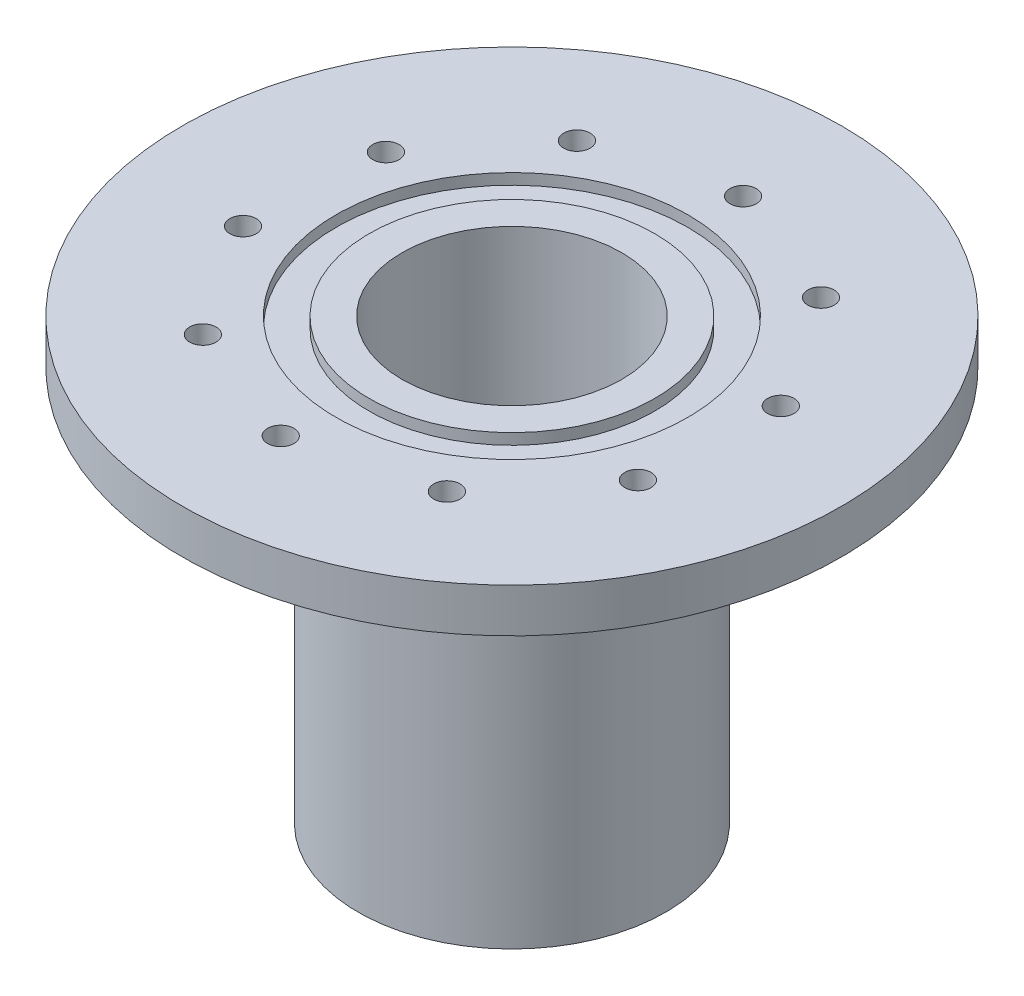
from build123d import *

# Parameters (mm, degrees)
F_12_0_12_DIAMETER_HOLE2_D = 12


with BuildPart() as part:
    # Sketch1 → Revolve1 (revolve)
    with BuildSketch(Plane.XY, mode=Mode.PRIVATE) as revolve1_sk:
        with BuildLine():
            Line((-50, 0), (-50, 200))
            Line((-50, 200), (-65, 200))
            Line((-65, 200), (-65, 195))
            Line((-65, 195), (-80, 195))
            Line((-80, 195), (-80, 200))
            Line((-80, 200), (-150, 200))
            Line((-150, 200), (-150, 180))
            Line((-150, 180), (-75, 180))
            ThreePointArc((-75, 180), (-71.464466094, 178.535533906), (-70, 175))
            Line((-70, 175), (-70, 0))
            Line((-70, 0), (-50, 0))
        make_face()
    revolve(revolve1_sk.sketch.rotate(Axis((0, 0, 0), (0, 1, 0)), 270), axis=Axis((0, 0, 0), (0, 1, 0)))

    # 12.0 _12_ Diameter Hole2 (through all)
    with Locations(Plane(origin=(-59.628192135, 240, -279.351148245), x_dir=(1, 0, 0), z_dir=(0, 1, 0))):
        with Locations((64.993321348, -179.495175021), (122.66254126, -201.719512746), (156.254782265, -253.596496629), (152.938950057, -315.310882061), (113.981579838, -363.289871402), (54.263062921, -379.207121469), (-3.40615699, -356.982783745), (-36.998397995, -305.105799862), (-33.682565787, -243.39141443), (5.274804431, -195.412425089)):
            Hole(F_12_0_12_DIAMETER_HOLE2_D / 2)


solid = part.part
